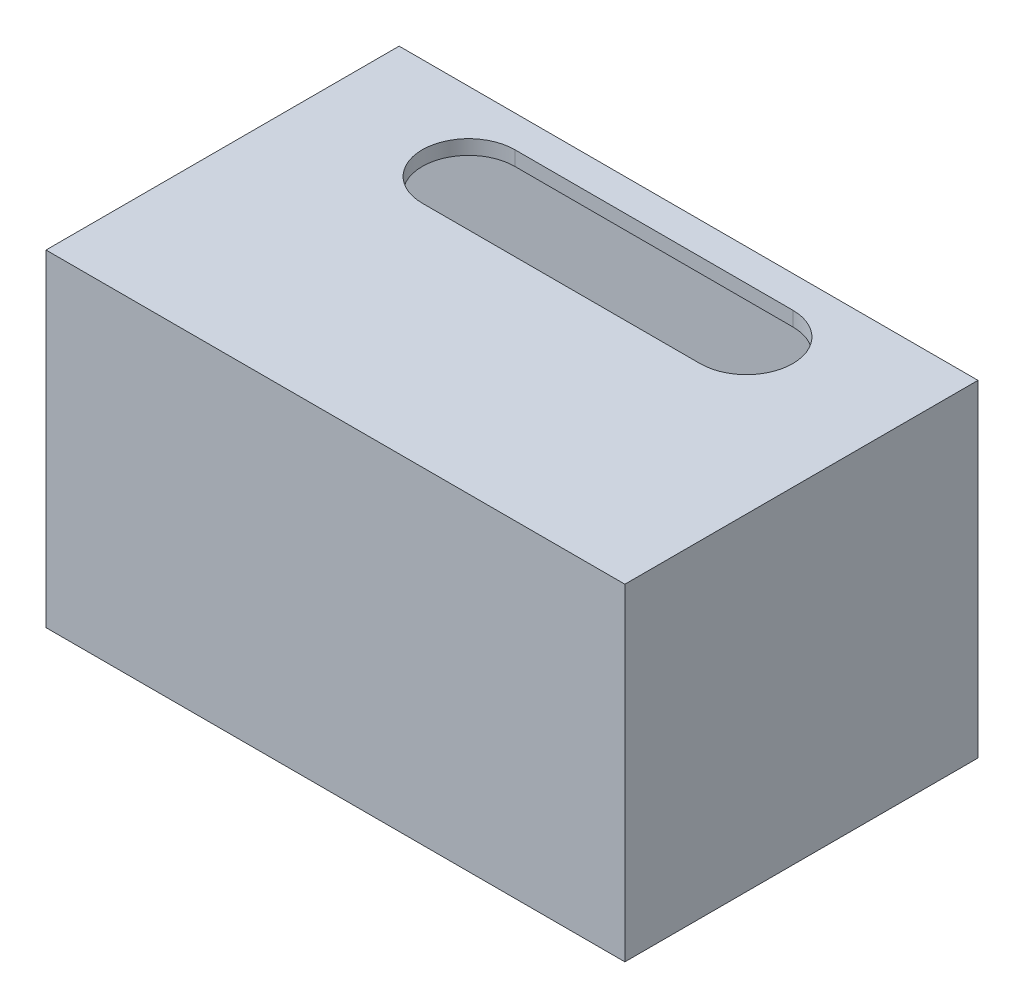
from build123d import *

# Parameters (mm, degrees)
SKETCH1_W                 = 63.5
SKETCH1_H                 = 38.735
EXTRUDE1_DEPTH            = 4.7625
SKETCH2_W                 = 63.5
SKETCH2_H                 = 38.735
SKETCH2_W_2               = 60.325
SKETCH2_H_2               = 35.56
EXTRUDE_THIN1_DEPTH       = 29.5275
SKETCH3_W                 = 63.5
SKETCH3_H                 = 38.735
EXTRUDE2_DEPTH            = 1.5875
F_8_32_TAPPED_HOLE1_D     = 3.4544
F_8_32_TAPPED_HOLE1_DEPTH = 12.446
F_8_32_TAPPED_HOLE1_TIP   = 1.037806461


with BuildPart() as part:
    # Sketch1 → Extrude1 (new body)
    with BuildSketch(Plane(origin=(0, 0, 0), x_dir=(1, 0, 0), z_dir=(0, 1, 0))):
        with Locations((31.75, 19.3675)):
            Rectangle(SKETCH1_W, SKETCH1_H)
    extrude(amount=EXTRUDE1_DEPTH)

    # Sketch2 → Extrude-Thin1 (add)
    with BuildSketch(Plane(origin=(0, 4.7625, 0), x_dir=(1, 0, 0), z_dir=(0, 1, 0))):
        with Locations((31.75, 19.3675)):
            Rectangle(SKETCH2_W, SKETCH2_H)
        with Locations((31.75, 19.3675)):
            Rectangle(SKETCH2_W_2, SKETCH2_H_2, mode=Mode.SUBTRACT)
    extrude(amount=EXTRUDE_THIN1_DEPTH)

    # Sketch3 → Extrude2 (add)
    with BuildSketch(Plane(origin=(0, 34.29, 0), x_dir=(1, 0, 0), z_dir=(0, 1, 0))):
        with Locations((31.75, 19.3675)):
            Rectangle(SKETCH3_W, SKETCH3_H)
        with BuildLine():
            Line((16.1925, 35.2425), (46.6725, 35.2425))
            ThreePointArc((46.6725, 35.2425), (51.7525, 30.1625), (46.6725, 25.0825))
            Line((46.6725, 25.0825), (16.1925, 25.0825))
            ThreePointArc((16.1925, 25.0825), (11.1125, 30.1625), (16.1925, 35.2425))
        make_face(mode=Mode.SUBTRACT)
    extrude(amount=EXTRUDE2_DEPTH)

    # 8-32 Tapped Hole1
    with Locations(Plane.ZY):
        with Locations((-29.21, 2.38125)):
            Hole(F_8_32_TAPPED_HOLE1_D / 2, depth=F_8_32_TAPPED_HOLE1_DEPTH)
            with Locations((0, 0, -(F_8_32_TAPPED_HOLE1_DEPTH + F_8_32_TAPPED_HOLE1_TIP / 2))):  # 118° drill point
                Cone(0, F_8_32_TAPPED_HOLE1_D / 2, F_8_32_TAPPED_HOLE1_TIP, mode=Mode.SUBTRACT)


solid = part.part
